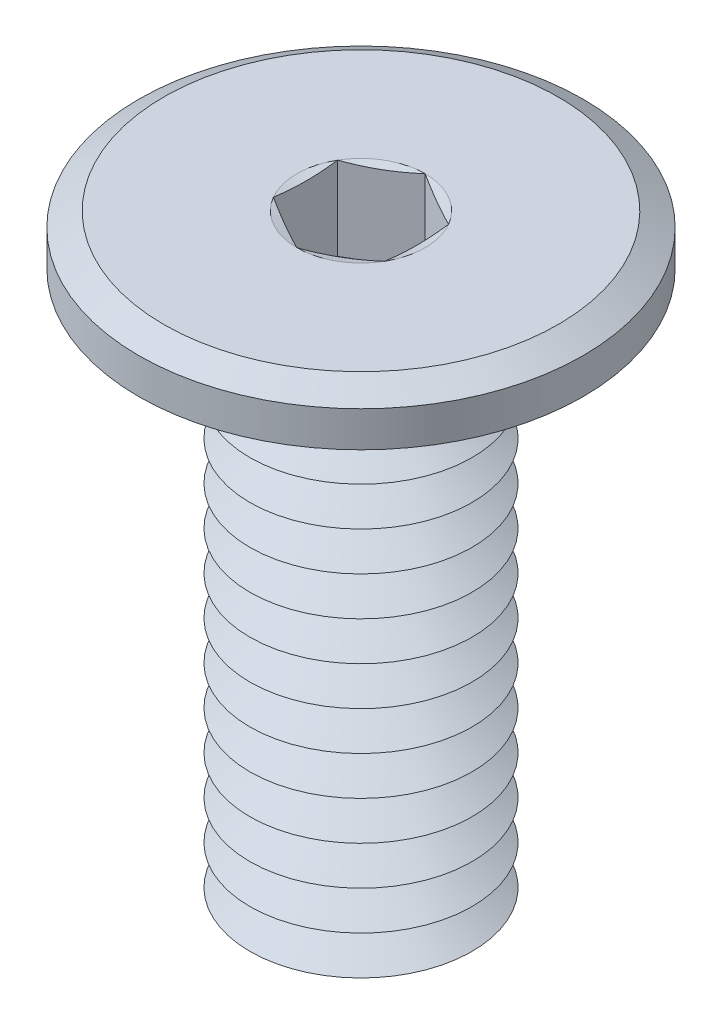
from build123d import *

# Parameters (mm, degrees)
SKETCH1_R           = 4
BOSS_EXTRUDE1_DEPTH = 0.9
SKETCH2_R           = 2
BOSS_EXTRUDE2_DEPTH = 10
LPATTERN1_COUNT     = 13
LPATTERN1_PITCH     = 0.7
FILLET1_R           = 0.2
CHAMFER2_SIZE       = 0.45
CHAMFER2_SIZE2      = 0.259807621
CUT_EXTRUDE1_DEPTH  = 1.5


with BuildPart() as part:
    # Sketch1 → Boss-Extrude1 (new body)
    with BuildSketch(Plane(origin=(0, 0, 0), x_dir=(1, 0, 0), z_dir=(0, 1, 0))):
        with Locations(Location((0, 0, 0), (0, 0, 270))):
            Circle(SKETCH1_R)
    extrude(amount=-BOSS_EXTRUDE1_DEPTH)

    # Sketch2 → Boss-Extrude2 (add)
    with BuildSketch(Plane.XZ.offset(0.9)):
        with Locations(Location((0, 0, 0), (0, 0, 270))):
            Circle(SKETCH2_R)
    extrude(amount=BOSS_EXTRUDE2_DEPTH)

    # Sketch5 → Cut-Revolve1 (revolve, cut)
    with BuildSketch(Plane(origin=(0, 0, 0), x_dir=(0, 0, -1), z_dir=(1, 0, 0))):
        Polygon((-2, -11.25), (-1.393782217, -10.9), (-2, -10.55), align=None)
    cut_revolve1 = revolve(axis=Axis((0, 0.990593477, 0), (0, -1, 0)), mode=Mode.SUBTRACT)

    # LPattern1: Cut-Revolve1 ×13
    with Locations(*[(0, i * LPATTERN1_PITCH, 0) for i in range(1, LPATTERN1_COUNT)]):
        add(cut_revolve1, mode=Mode.SUBTRACT)

    # Fillet1
    fillet1_edges = [part.edges().sort_by_distance(p)[0] for p in [
        (0, -0.9, 2),
    ]]
    fillet(fillet1_edges, radius=FILLET1_R)

    # Chamfer2
    chamfer2_edges = [part.edges().sort_by_distance(p)[0] for p in [
        (0, 0, -4),
    ]]
    chamfer2_side = [part.faces().sort_by_distance(p)[0] for p in [
        (0, 0, 0),
    ]]
    chamfer(chamfer2_edges, length=CHAMFER2_SIZE, length2=CHAMFER2_SIZE2, reference=chamfer2_side[0])

    # Sketch6 → Cut-Extrude1 (cut)
    with BuildSketch(Plane(origin=(0, 0, 0), x_dir=(1, 0, 0), z_dir=(0, 1, 0))):
        Polygon((0, 1.154700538), (-1, 0.577350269), (-1, -0.577350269), (0, -1.154700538), (1, -0.577350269), (1, 0.577350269), align=None)
    extrude(amount=-CUT_EXTRUDE1_DEPTH, mode=Mode.SUBTRACT)

    # Cut-Extrude2 cone 1 section (on through the dimple's axis) → Cut-Extrude2 (revolve, cut)
    with BuildSketch(Plane(origin=(0, -1.5, 0), x_dir=(0, 0, 1), z_dir=(1, 0, 0))):
        Polygon((0, 0), (1, 0), (0, 0.577350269), align=None)
    revolve(axis=Axis((0, -1.5, 0), (0, -1, 0)), mode=Mode.SUBTRACT)

    # Cut-Extrude3 cone 1 section (on through the dimple's axis) → Cut-Extrude3 (revolve, cut)
    with BuildSketch(Plane(origin=(0, 0, 0), x_dir=(0, 0, 1), z_dir=(1, 0, 0))):
        Polygon((0, 0), (1.154700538, 0), (0, 0.309401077), align=None)
    revolve(axis=Axis((0, 0, 0), (0, -1, 0)), mode=Mode.SUBTRACT)


solid = part.part
